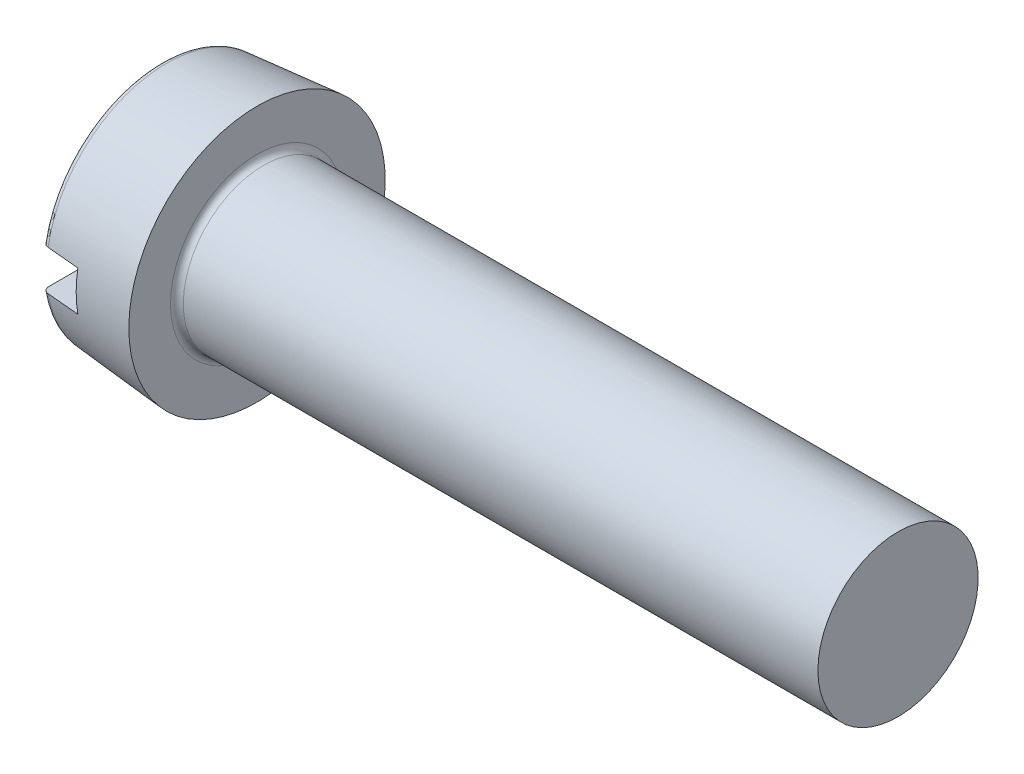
ISO-10303-21;
HEADER;
FILE_DESCRIPTION(('STEP AP214'),'2;1');
FILE_NAME('part.step','',(''),(''),'','','');
FILE_SCHEMA(('AUTOMOTIVE_DESIGN { 1 0 10303 214 1 1 1 1 }'));
ENDSEC;
DATA;
#1=APPLICATION_CONTEXT('core data for automotive mechanical design processes');
#2=APPLICATION_PROTOCOL_DEFINITION('international standard','automotive_design',2000,#1);
#3=PRODUCT_CONTEXT('',#1,'mechanical');
#4=PRODUCT('Part','Part','',(#3));
#5=PRODUCT_RELATED_PRODUCT_CATEGORY('part','',(#4));
#6=PRODUCT_DEFINITION_FORMATION('','',#4);
#7=PRODUCT_DEFINITION_CONTEXT('part definition',#1,'design');
#8=PRODUCT_DEFINITION('design','',#6,#7);
#9=PRODUCT_DEFINITION_SHAPE('','',#8);
#10=(LENGTH_UNIT() NAMED_UNIT(*) SI_UNIT(.MILLI.,.METRE.));
#11=(NAMED_UNIT(*) PLANE_ANGLE_UNIT() SI_UNIT($,.RADIAN.));
#12=(NAMED_UNIT(*) SI_UNIT($,.STERADIAN.) SOLID_ANGLE_UNIT());
#13=UNCERTAINTY_MEASURE_WITH_UNIT(LENGTH_MEASURE(1.E-05),#10,'distance_accuracy_value','');
#14=(GEOMETRIC_REPRESENTATION_CONTEXT(3) GLOBAL_UNCERTAINTY_ASSIGNED_CONTEXT((#13)) GLOBAL_UNIT_ASSIGNED_CONTEXT((#10,
#11,#12)) REPRESENTATION_CONTEXT('',''));
#15=CARTESIAN_POINT('',(0.,0.,0.));
#16=DIRECTION('',(0.,0.,1.));
#17=DIRECTION('',(1.,0.,0.));
#18=AXIS2_PLACEMENT_3D('',#15,#16,#17);
#19=CARTESIAN_POINT('',(0.,0.,0.));
#20=DIRECTION('',(1.,0.,0.));
#21=DIRECTION('',(0.,0.,-1.));
#22=AXIS2_PLACEMENT_3D('',#19,#20,#21);
#23=PLANE('',#22);
#24=CARTESIAN_POINT('',(0.,0.,0.));
#25=DIRECTION('',(1.,0.,0.));
#26=DIRECTION('',(0.,0.,-1.));
#27=AXIS2_PLACEMENT_3D('',#24,#25,#26);
#28=CIRCLE('',#27,7.10853554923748);
#29=CARTESIAN_POINT('',(0.,1.25,6.99776947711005));
#30=VERTEX_POINT('',#29);
#31=CARTESIAN_POINT('',(0.,1.25,-6.99776947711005));
#32=VERTEX_POINT('',#31);
#33=EDGE_CURVE('E115',#30,#32,#28,.F.);
#34=ORIENTED_EDGE('',*,*,#33,.T.);
#35=DIRECTION('',(0.,0.,-1.));
#36=VECTOR('',#35,1.);
#37=CARTESIAN_POINT('',(0.,1.25,-8.));
#38=LINE('',#37,#36);
#39=EDGE_CURVE('E112',#30,#32,#38,.T.);
#40=ORIENTED_EDGE('',*,*,#39,.F.);
#41=EDGE_LOOP('',(#34,#40));
#42=FACE_BOUND('',#41,.T.);
#43=ADVANCED_FACE('F45',(#42),#23,.F.);
#44=CARTESIAN_POINT('',(0.4,0.,0.));
#45=DIRECTION('',(1.,0.,0.));
#46=DIRECTION('',(0.,0.,-1.));
#47=AXIS2_PLACEMENT_3D('',#44,#45,#46);
#48=TOROIDAL_SURFACE('',#47,7.10853554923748,0.4);
#49=CARTESIAN_POINT('',(0.132475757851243,1.25,-7.29965638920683));
#50=CARTESIAN_POINT('',(0.148990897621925,1.25,-7.31472881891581));
#51=CARTESIAN_POINT('',(0.166777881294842,1.25,-7.32842972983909));
#52=CARTESIAN_POINT('',(0.204409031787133,1.25,-7.35266985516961));
#53=CARTESIAN_POINT('',(0.224255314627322,1.25,-7.36320577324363));
#54=CARTESIAN_POINT('',(0.265441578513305,1.25,-7.38078477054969));
#55=CARTESIAN_POINT('',(0.286781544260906,1.25,-7.38782788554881));
#56=CARTESIAN_POINT('',(0.330340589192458,1.25,-7.39820117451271));
#57=CARTESIAN_POINT('',(0.35255945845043,1.25,-7.40153222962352));
#58=CARTESIAN_POINT('',(0.397089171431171,1.25,-7.40437165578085));
#59=CARTESIAN_POINT('',(0.419398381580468,1.25,-7.40390568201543));
#60=CARTESIAN_POINT('',(0.463620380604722,1.25,-7.39922637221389));
#61=CARTESIAN_POINT('',(0.485533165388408,1.25,-7.39501299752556));
#62=CARTESIAN_POINT('',(0.528297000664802,1.25,-7.38298011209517));
#63=CARTESIAN_POINT('',(0.549150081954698,1.25,-7.37516781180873));
#64=CARTESIAN_POINT('',(0.589260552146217,1.25,-7.35617509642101));
#65=CARTESIAN_POINT('',(0.608517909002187,1.25,-7.34499461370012));
#66=CARTESIAN_POINT('',(0.645030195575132,1.25,-7.31951314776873));
#67=CARTESIAN_POINT('',(0.662271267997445,1.25,-7.30519231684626));
#68=CARTESIAN_POINT('',(0.694141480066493,1.25,-7.27389212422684));
#69=CARTESIAN_POINT('',(0.70877046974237,1.25,-7.25691260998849));
#70=CARTESIAN_POINT('',(0.735200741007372,1.25,-7.22055032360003));
#71=CARTESIAN_POINT('',(0.746964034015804,1.25,-7.20113994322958));
#72=CARTESIAN_POINT('',(0.767117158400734,1.25,-7.16064078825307));
#73=CARTESIAN_POINT('',(0.775506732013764,1.25,-7.13955188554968));
#74=CARTESIAN_POINT('',(0.788794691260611,1.25,-7.09597716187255));
#75=CARTESIAN_POINT('',(0.793642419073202,1.25,-7.07347588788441));
#76=CARTESIAN_POINT('',(0.79953214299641,1.25,-7.02798039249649));
#77=CARTESIAN_POINT('',(0.800573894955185,1.25,-7.00498613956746));
#78=CARTESIAN_POINT('',(0.79881979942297,1.25,-6.95891765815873));
#79=CARTESIAN_POINT('',(0.795986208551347,1.25,-6.93584485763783));
#80=CARTESIAN_POINT('',(0.786490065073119,1.25,-6.89050028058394));
#81=CARTESIAN_POINT('',(0.779827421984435,1.25,-6.86822852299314));
#82=CARTESIAN_POINT('',(0.762840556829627,1.25,-6.82510415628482));
#83=CARTESIAN_POINT('',(0.75251312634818,1.25,-6.80425280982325));
#84=CARTESIAN_POINT('',(0.728472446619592,1.25,-6.76460179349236));
#85=CARTESIAN_POINT('',(0.714759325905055,1.25,-6.74580204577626));
#86=CARTESIAN_POINT('',(0.684465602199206,1.25,-6.71098630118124));
#87=CARTESIAN_POINT('',(0.667913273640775,1.25,-6.6949457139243));
#88=CARTESIAN_POINT('',(0.632312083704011,1.25,-6.66592631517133));
#89=CARTESIAN_POINT('',(0.613263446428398,1.25,-6.6529472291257));
#90=CARTESIAN_POINT('',(0.573538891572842,1.25,-6.63064399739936));
#91=CARTESIAN_POINT('',(0.552894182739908,1.25,-6.62126426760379));
#92=CARTESIAN_POINT('',(0.510307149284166,1.25,-6.60616480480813));
#93=CARTESIAN_POINT('',(0.488364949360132,1.25,-6.60044472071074));
#94=CARTESIAN_POINT('',(0.444162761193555,1.25,-6.59290706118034));
#95=CARTESIAN_POINT('',(0.421912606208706,1.25,-6.59103174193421));
#96=CARTESIAN_POINT('',(0.377416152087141,1.25,-6.59106992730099));
#97=CARTESIAN_POINT('',(0.355169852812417,1.25,-6.59298324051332));
#98=CARTESIAN_POINT('',(0.311460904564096,1.25,-6.60051294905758));
#99=CARTESIAN_POINT('',(0.289994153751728,1.25,-6.60610558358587));
#100=CARTESIAN_POINT('',(0.248296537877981,1.25,-6.62079614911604));
#101=CARTESIAN_POINT('',(0.228065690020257,1.25,-6.62989412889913));
#102=CARTESIAN_POINT('',(0.189287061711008,1.25,-6.65137810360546));
#103=CARTESIAN_POINT('',(0.17074920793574,1.25,-6.66378200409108));
#104=CARTESIAN_POINT('',(0.135980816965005,1.25,-6.69148453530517));
#105=CARTESIAN_POINT('',(0.119750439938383,1.25,-6.7067833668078));
#106=CARTESIAN_POINT('',(0.0898040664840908,1.25,-6.74007476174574));
#107=CARTESIAN_POINT('',(0.0761278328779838,1.25,-6.75810308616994));
#108=CARTESIAN_POINT('',(0.051938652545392,1.25,-6.79616955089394));
#109=CARTESIAN_POINT('',(0.0414259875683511,1.25,-6.81620786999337));
#110=CARTESIAN_POINT('',(0.0236867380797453,1.25,-6.85807628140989));
#111=CARTESIAN_POINT('',(0.0165164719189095,1.25,-6.87993024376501));
#112=CARTESIAN_POINT('',(0.00590326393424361,1.25,-6.92452467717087));
#113=CARTESIAN_POINT('',(0.00246043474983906,1.25,-6.94726517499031));
#114=CARTESIAN_POINT('',(-0.0006244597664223,1.25,-6.9932443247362));
#115=CARTESIAN_POINT('',(-0.000226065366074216,1.25,-7.01648570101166));
#116=CARTESIAN_POINT('',(0.00446361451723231,1.25,-7.06257934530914));
#117=CARTESIAN_POINT('',(0.00875592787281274,1.25,-7.08543150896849));
#118=CARTESIAN_POINT('',(0.0211326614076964,1.25,-7.13011343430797));
#119=CARTESIAN_POINT('',(0.0292216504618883,1.25,-7.15194192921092));
#120=CARTESIAN_POINT('',(0.0489774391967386,1.25,-7.1938938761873));
#121=CARTESIAN_POINT('',(0.0606398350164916,1.25,-7.21401938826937));
#122=CARTESIAN_POINT('',(0.0824216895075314,1.25,-7.24513458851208));
#123=CARTESIAN_POINT('',(0.091585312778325,1.25,-7.25680502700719));
#124=CARTESIAN_POINT('',(0.111138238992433,1.25,-7.27907001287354));
#125=CARTESIAN_POINT('',(0.121527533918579,1.25,-7.28966456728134));
#126=CARTESIAN_POINT('',(0.132475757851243,1.25,-7.29965638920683));
#127=B_SPLINE_CURVE_WITH_KNOTS('',3,(#49,#50,#51,#52,#53,#54,#55,#56,#57,#58,#59,#60,#61,#62,
#63,#64,#65,#66,#67,#68,#69,#70,#71,#72,#73,#74,#75,#76,#77,#78,#79,#80,#81,#82,#83,#84,#85,#86,
#87,#88,#89,#90,#91,#92,#93,#94,#95,#96,#97,#98,#99,#100,#101,#102,#103,#104,#105,#106,#107,
#108,#109,#110,#111,#112,#113,#114,#115,#116,#117,#118,#119,#120,#121,#122,#123,#124,#125,#126),
.UNSPECIFIED.,.T.,.F.,(4,2,2,2,2,2,2,2,2,2,2,2,2,2,2,2,2,2,2,2,2,2,2,2,2,2,2,2,2,2,2,2,2,2,2,2,
2,2,4),(0.,0.067023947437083,0.134117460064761,0.20121028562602,0.268287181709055,
0.334911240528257,0.401535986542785,0.468027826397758,0.534521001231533,0.601447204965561,
0.66837724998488,0.736151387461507,0.803930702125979,0.87266141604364,0.94139653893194,
1.01080588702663,1.08021687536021,1.14968878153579,1.21915805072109,1.28797189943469,
1.35677957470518,1.4244772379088,1.49216840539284,1.55883525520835,1.62549873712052,
1.69173588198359,1.75797394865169,1.82457833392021,1.891187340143,1.95875976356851,
2.02633820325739,2.09501746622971,2.1636988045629,2.23310434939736,2.30252822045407,
2.37203585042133,2.44145816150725,2.48588999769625,2.53032154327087),.UNSPECIFIED.);
#128=CARTESIAN_POINT('',(0.365137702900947,1.25,-7.40221254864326));
#129=VERTEX_POINT('',#128);
#130=EDGE_CURVE('E69',#32,#129,#127,.T.);
#131=ORIENTED_EDGE('',*,*,#130,.F.);
#132=ORIENTED_EDGE('',*,*,#33,.F.);
#133=CARTESIAN_POINT('',(0.156685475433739,1.25,6.67501605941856));
#134=CARTESIAN_POINT('',(0.174256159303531,1.25,6.66131739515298));
#135=CARTESIAN_POINT('',(0.192982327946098,1.25,6.64907708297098));
#136=CARTESIAN_POINT('',(0.232233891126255,1.25,6.62789477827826));
#137=CARTESIAN_POINT('',(0.252761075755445,1.25,6.61895611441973));
#138=CARTESIAN_POINT('',(0.295032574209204,1.25,6.60466535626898));
#139=CARTESIAN_POINT('',(0.316776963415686,1.25,6.59931348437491));
#140=CARTESIAN_POINT('',(0.360853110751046,1.25,6.59236998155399));
#141=CARTESIAN_POINT('',(0.383184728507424,1.25,6.59077746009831));
#142=CARTESIAN_POINT('',(0.42762602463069,1.25,6.591398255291));
#143=CARTESIAN_POINT('',(0.44973610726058,1.25,6.59358298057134));
#144=CARTESIAN_POINT('',(0.493275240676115,1.25,6.60163431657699));
#145=CARTESIAN_POINT('',(0.514704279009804,1.25,6.60750099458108));
#146=CARTESIAN_POINT('',(0.556279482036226,1.25,6.6227333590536));
#147=CARTESIAN_POINT('',(0.576425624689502,1.25,6.63209910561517));
#148=CARTESIAN_POINT('',(0.614883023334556,1.25,6.65404433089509));
#149=CARTESIAN_POINT('',(0.633194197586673,1.25,6.66662395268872));
#150=CARTESIAN_POINT('',(0.667684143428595,1.25,6.69478087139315));
#151=CARTESIAN_POINT('',(0.683837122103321,1.25,6.71038975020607));
#152=CARTESIAN_POINT('',(0.713345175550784,1.25,6.74405889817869));
#153=CARTESIAN_POINT('',(0.726700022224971,1.25,6.76211936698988));
#154=CARTESIAN_POINT('',(0.750464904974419,1.25,6.80049672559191));
#155=CARTESIAN_POINT('',(0.760822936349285,1.25,6.82084582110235));
#156=CARTESIAN_POINT('',(0.778030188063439,1.25,6.86297712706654));
#157=CARTESIAN_POINT('',(0.784879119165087,1.25,6.88475945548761));
#158=CARTESIAN_POINT('',(0.79496410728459,1.25,6.92946740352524));
#159=CARTESIAN_POINT('',(0.798148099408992,1.25,6.95240477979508));
#160=CARTESIAN_POINT('',(0.800643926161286,1.25,6.99848978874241));
#161=CARTESIAN_POINT('',(0.799955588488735,1.25,7.02163743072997));
#162=CARTESIAN_POINT('',(0.794705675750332,1.25,7.06762095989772));
#163=CARTESIAN_POINT('',(0.790122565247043,1.25,7.0904543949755));
#164=CARTESIAN_POINT('',(0.777170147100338,1.25,7.13502176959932));
#165=CARTESIAN_POINT('',(0.768800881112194,1.25,7.15675572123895));
#166=CARTESIAN_POINT('',(0.748544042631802,1.25,7.19839107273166));
#167=CARTESIAN_POINT('',(0.736673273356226,1.25,7.2183006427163));
#168=CARTESIAN_POINT('',(0.709718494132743,1.25,7.25581170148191));
#169=CARTESIAN_POINT('',(0.694634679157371,1.25,7.27341333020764));
#170=CARTESIAN_POINT('',(0.661876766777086,1.25,7.30557422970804));
#171=CARTESIAN_POINT('',(0.644236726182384,1.25,7.32016818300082));
#172=CARTESIAN_POINT('',(0.606727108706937,1.25,7.34613622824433));
#173=CARTESIAN_POINT('',(0.586857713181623,1.25,7.35751058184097));
#174=CARTESIAN_POINT('',(0.545758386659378,1.25,7.37654767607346));
#175=CARTESIAN_POINT('',(0.524551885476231,1.25,7.38426101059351));
#176=CARTESIAN_POINT('',(0.481137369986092,1.25,7.39597548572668));
#177=CARTESIAN_POINT('',(0.458929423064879,1.25,7.39997687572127));
#178=CARTESIAN_POINT('',(0.414390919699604,1.25,7.40412092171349));
#179=CARTESIAN_POINT('',(0.392064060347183,1.25,7.40430340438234));
#180=CARTESIAN_POINT('',(0.347698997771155,1.25,7.40090585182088));
#181=CARTESIAN_POINT('',(0.325660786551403,1.25,7.39732592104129));
#182=CARTESIAN_POINT('',(0.282559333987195,1.25,7.38652855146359));
#183=CARTESIAN_POINT('',(0.26149359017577,1.25,7.37932109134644));
#184=CARTESIAN_POINT('',(0.220861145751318,1.25,7.36149175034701));
#185=CARTESIAN_POINT('',(0.201294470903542,1.25,7.35086981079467));
#186=CARTESIAN_POINT('',(0.164087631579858,1.25,7.32645533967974));
#187=CARTESIAN_POINT('',(0.146459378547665,1.25,7.31264466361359));
#188=CARTESIAN_POINT('',(0.113736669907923,1.25,7.28229253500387));
#189=CARTESIAN_POINT('',(0.0986423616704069,1.25,7.26575092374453));
#190=CARTESIAN_POINT('',(0.0712157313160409,1.25,7.23019262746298));
#191=CARTESIAN_POINT('',(0.0589194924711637,1.25,7.2111481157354));
#192=CARTESIAN_POINT('',(0.0376470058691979,1.25,7.17128762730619));
#193=CARTESIAN_POINT('',(0.0286710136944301,1.25,7.15047151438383));
#194=CARTESIAN_POINT('',(0.0141628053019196,1.25,7.10734319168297));
#195=CARTESIAN_POINT('',(0.00868112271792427,1.25,7.08501397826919));
#196=CARTESIAN_POINT('',(0.00150168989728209,1.25,7.03975592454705));
#197=CARTESIAN_POINT('',(-0.000195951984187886,1.25,7.01682706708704));
#198=CARTESIAN_POINT('',(0.000234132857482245,1.25,6.97076875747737));
#199=CARTESIAN_POINT('',(0.00240136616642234,1.25,6.94763966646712));
#200=CARTESIAN_POINT('',(0.0105811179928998,1.25,6.90206456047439));
#201=CARTESIAN_POINT('',(0.016594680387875,1.25,6.87961873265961));
#202=CARTESIAN_POINT('',(0.0323258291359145,1.25,6.83600920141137));
#203=CARTESIAN_POINT('',(0.0420516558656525,1.25,6.81484847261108));
#204=CARTESIAN_POINT('',(0.0649421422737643,1.25,6.77449865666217));
#205=CARTESIAN_POINT('',(0.0781025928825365,1.25,6.75530719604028));
#206=CARTESIAN_POINT('',(0.102248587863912,1.25,6.72585361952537));
#207=CARTESIAN_POINT('',(0.112339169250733,1.25,6.7148457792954));
#208=CARTESIAN_POINT('',(0.133675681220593,1.25,6.69401274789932));
#209=CARTESIAN_POINT('',(0.144921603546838,1.25,6.68418754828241));
#210=CARTESIAN_POINT('',(0.156685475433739,1.25,6.67501605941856));
#211=B_SPLINE_CURVE_WITH_KNOTS('',3,(#133,#134,#135,#136,#137,#138,#139,#140,#141,#142,#143,
#144,#145,#146,#147,#148,#149,#150,#151,#152,#153,#154,#155,#156,#157,#158,#159,#160,#161,#162,
#163,#164,#165,#166,#167,#168,#169,#170,#171,#172,#173,#174,#175,#176,#177,#178,#179,#180,#181,
#182,#183,#184,#185,#186,#187,#188,#189,#190,#191,#192,#193,#194,#195,#196,#197,#198,#199,#200,
#201,#202,#203,#204,#205,#206,#207,#208,#209,#210),.UNSPECIFIED.,.T.,.F.,(4,2,2,2,2,2,2,2,2,2,2,
2,2,2,2,2,2,2,2,2,2,2,2,2,2,2,2,2,2,2,2,2,2,2,2,2,2,2,4),(0.,0.0667854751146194,
0.133638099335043,0.200494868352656,0.267335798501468,0.333672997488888,0.400011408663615,
0.466350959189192,0.532693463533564,0.599768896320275,0.666849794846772,0.735033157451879,
0.803222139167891,0.872368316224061,0.941517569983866,1.01105167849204,1.08058502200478,
1.14978996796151,1.2189907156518,1.28734229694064,1.35568832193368,1.42306015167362,
1.49042745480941,1.55709184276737,1.62375438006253,1.69023453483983,1.75671583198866,
1.82358517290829,1.89045840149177,1.9581504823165,2.02584777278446,2.09450310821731,
2.1631604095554,2.23252355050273,2.30190552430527,2.37144241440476,2.4408944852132,
2.48560881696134,2.53032282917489),.UNSPECIFIED.);
#212=CARTESIAN_POINT('',(0.365137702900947,1.25,7.40221254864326));
#213=VERTEX_POINT('',#212);
#214=EDGE_CURVE('E105',#213,#30,#211,.T.);
#215=ORIENTED_EDGE('',*,*,#214,.F.);
#216=CARTESIAN_POINT('',(0.365137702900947,0.,0.));
#217=DIRECTION('',(-1.,0.,0.));
#218=DIRECTION('',(0.,0.,1.));
#219=AXIS2_PLACEMENT_3D('',#216,#217,#218);
#220=CIRCLE('',#219,7.50701342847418);
#221=EDGE_CURVE('E114',#129,#213,#220,.F.);
#222=ORIENTED_EDGE('',*,*,#221,.F.);
#223=EDGE_LOOP('',(#131,#132,#215,#222));
#224=FACE_BOUND('',#223,.T.);
#225=ADVANCED_FACE('F208',(#224),#48,.T.);
#226=CARTESIAN_POINT('',(0.,-1.25,-6.99776947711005));
#227=VERTEX_POINT('',#226);
#228=CARTESIAN_POINT('',(0.,-1.25,6.99776947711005));
#229=VERTEX_POINT('',#228);
#230=EDGE_CURVE('E111',#227,#229,#28,.F.);
#231=ORIENTED_EDGE('',*,*,#230,.T.);
#232=DIRECTION('',(0.,0.,1.));
#233=VECTOR('',#232,1.);
#234=CARTESIAN_POINT('',(0.,-1.25,-8.));
#235=LINE('',#234,#233);
#236=EDGE_CURVE('E61',#227,#229,#235,.T.);
#237=ORIENTED_EDGE('',*,*,#236,.F.);
#238=EDGE_LOOP('',(#231,#237));
#239=FACE_BOUND('',#238,.T.);
#240=ADVANCED_FACE('F110',(#239),#23,.F.);
#241=CARTESIAN_POINT('',(6.,0.,0.));
#242=DIRECTION('',(1.,0.,0.));
#243=DIRECTION('',(0.,0.,-1.));
#244=AXIS2_PLACEMENT_3D('',#241,#242,#243);
#245=CONICAL_SURFACE('',#244,8.,0.0872664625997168);
#246=CARTESIAN_POINT('',(2.4,0.,0.));
#247=DIRECTION('',(-1.,0.,0.));
#248=DIRECTION('',(0.,0.,1.));
#249=AXIS2_PLACEMENT_3D('',#246,#247,#248);
#250=CIRCLE('',#249,7.68504081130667);
#251=CARTESIAN_POINT('',(2.4,1.25,-7.58270085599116));
#252=VERTEX_POINT('',#251);
#253=CARTESIAN_POINT('',(2.4,-1.25,-7.58270085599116));
#254=VERTEX_POINT('',#253);
#255=EDGE_CURVE('E11',#252,#254,#250,.T.);
#256=ORIENTED_EDGE('',*,*,#255,.F.);
#257=CARTESIAN_POINT('',(15.1487514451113,1.25,-8.71118545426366));
#258=CARTESIAN_POINT('',(12.8323092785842,1.25,-8.50644348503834));
#259=CARTESIAN_POINT('',(10.5158792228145,1.25,-8.3015643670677));
#260=CARTESIAN_POINT('',(5.88305125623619,1.25,-7.89144412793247));
#261=CARTESIAN_POINT('',(3.56665334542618,1.25,-7.68620300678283));
#262=CARTESIAN_POINT('',(-1.06610264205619,1.25,-7.2752710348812));
#263=CARTESIAN_POINT('',(-3.38246071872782,1.25,-7.06958018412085));
#264=CARTESIAN_POINT('',(-8.01512399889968,1.25,-6.65760290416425));
#265=CARTESIAN_POINT('',(-10.3314292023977,1.25,-6.45131647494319));
#266=CARTESIAN_POINT('',(-12.6477013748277,1.25,-6.24465933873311));
#267=B_SPLINE_CURVE_WITH_KNOTS('',3,(#257,#258,#259,#260,#261,#262,#263,#264,#265,#266),
.UNSPECIFIED.,.F.,.F.,(4,2,2,2,4),(0.,6.97641830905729,13.9528363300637,20.9292544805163,
27.9056729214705),.UNSPECIFIED.);
#268=EDGE_CURVE('E178',#252,#129,#267,.T.);
#269=ORIENTED_EDGE('',*,*,#268,.T.);
#270=ORIENTED_EDGE('',*,*,#221,.T.);
#271=CARTESIAN_POINT('',(-12.6477013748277,1.25,6.24465933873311));
#272=CARTESIAN_POINT('',(-8.75782940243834,1.25,6.59168512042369));
#273=CARTESIAN_POINT('',(-4.86786867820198,1.25,6.93771339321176));
#274=CARTESIAN_POINT('',(-0.23514008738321,1.25,7.34895529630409));
#275=CARTESIAN_POINT('',(0.507566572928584,1.25,7.41485821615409));
#276=CARTESIAN_POINT('',(5.88303167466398,1.25,7.89166585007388));
#277=CARTESIAN_POINT('',(10.5158712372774,1.25,8.30165647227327));
#278=CARTESIAN_POINT('',(15.1487514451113,1.25,8.71118545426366));
#279=B_SPLINE_CURVE_WITH_KNOTS('',3,(#271,#272,#273,#274,#275,#276,#277,#278),.UNSPECIFIED.,.F.,
.F.,(4,2,2,4),(0.,11.7159620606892,13.952836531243,27.9056728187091),.UNSPECIFIED.);
#280=CARTESIAN_POINT('',(2.4,1.25,7.58270085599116));
#281=VERTEX_POINT('',#280);
#282=EDGE_CURVE('E172',#213,#281,#279,.T.);
#283=ORIENTED_EDGE('',*,*,#282,.T.);
#284=CARTESIAN_POINT('',(2.4,-1.25,7.58270085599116));
#285=VERTEX_POINT('',#284);
#286=EDGE_CURVE('E50',#285,#281,#250,.T.);
#287=ORIENTED_EDGE('',*,*,#286,.F.);
#288=CARTESIAN_POINT('',(15.1487514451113,-1.25,8.71118545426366));
#289=CARTESIAN_POINT('',(12.8323092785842,-1.25,8.50644348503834));
#290=CARTESIAN_POINT('',(10.5158792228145,-1.25,8.3015643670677));
#291=CARTESIAN_POINT('',(5.88305125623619,-1.25,7.89144412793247));
#292=CARTESIAN_POINT('',(3.56665334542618,-1.25,7.68620300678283));
#293=CARTESIAN_POINT('',(-1.06610264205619,-1.25,7.2752710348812));
#294=CARTESIAN_POINT('',(-3.38246071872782,-1.25,7.06958018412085));
#295=CARTESIAN_POINT('',(-8.01512399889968,-1.25,6.65760290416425));
#296=CARTESIAN_POINT('',(-10.3314292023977,-1.25,6.45131647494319));
#297=CARTESIAN_POINT('',(-12.6477013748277,-1.25,6.24465933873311));
#298=B_SPLINE_CURVE_WITH_KNOTS('',3,(#288,#289,#290,#291,#292,#293,#294,#295,#296,#297),
.UNSPECIFIED.,.F.,.F.,(4,2,2,2,4),(0.,6.97641830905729,13.9528363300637,20.9292544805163,
27.9056729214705),.UNSPECIFIED.);
#299=CARTESIAN_POINT('',(0.365137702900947,-1.25,7.40221254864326));
#300=VERTEX_POINT('',#299);
#301=EDGE_CURVE('E147',#285,#300,#298,.T.);
#302=ORIENTED_EDGE('',*,*,#301,.T.);
#303=CARTESIAN_POINT('',(0.365137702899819,-1.25,-7.40221254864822));
#304=VERTEX_POINT('',#303);
#305=EDGE_CURVE('E118',#300,#304,#220,.F.);
#306=ORIENTED_EDGE('',*,*,#305,.T.);
#307=CARTESIAN_POINT('',(-12.6477013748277,-1.25,-6.24465933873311));
#308=CARTESIAN_POINT('',(-8.7578294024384,-1.25,-6.59168512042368));
#309=CARTESIAN_POINT('',(-4.86786867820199,-1.25,-6.93771339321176));
#310=CARTESIAN_POINT('',(-0.235140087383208,-1.25,-7.34895529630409));
#311=CARTESIAN_POINT('',(0.507566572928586,-1.25,-7.41485821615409));
#312=CARTESIAN_POINT('',(5.88303167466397,-1.25,-7.89166585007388));
#313=CARTESIAN_POINT('',(10.5158712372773,-1.25,-8.30165647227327));
#314=CARTESIAN_POINT('',(15.1487514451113,-1.25,-8.71118545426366));
#315=B_SPLINE_CURVE_WITH_KNOTS('',3,(#307,#308,#309,#310,#311,#312,#313,#314),.UNSPECIFIED.,.F.,
.F.,(4,2,2,4),(0.,11.7159620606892,13.952836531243,27.9056728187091),.UNSPECIFIED.);
#316=EDGE_CURVE('E100',#304,#254,#315,.T.);
#317=ORIENTED_EDGE('',*,*,#316,.T.);
#318=EDGE_LOOP('',(#256,#269,#270,#283,#287,#302,#306,#317));
#319=FACE_BOUND('',#318,.T.);
#320=CARTESIAN_POINT('',(6.,0.,0.));
#321=DIRECTION('',(-1.,0.,0.));
#322=DIRECTION('',(0.,0.,1.));
#323=AXIS2_PLACEMENT_3D('',#320,#321,#322);
#324=CIRCLE('',#323,8.);
#325=CARTESIAN_POINT('',(6.,0.,8.));
#326=VERTEX_POINT('',#325);
#327=EDGE_CURVE('E187',#326,#326,#324,.T.);
#328=ORIENTED_EDGE('',*,*,#327,.T.);
#329=EDGE_LOOP('',(#328));
#330=FACE_BOUND('',#329,.T.);
#331=ADVANCED_FACE('F161',(#319,#330),#245,.T.);
#332=CARTESIAN_POINT('',(6.,8.,0.));
#333=DIRECTION('',(-1.,0.,0.));
#334=DIRECTION('',(0.,0.,1.));
#335=AXIS2_PLACEMENT_3D('',#332,#333,#334);
#336=PLANE('',#335);
#337=CARTESIAN_POINT('',(6.,0.,0.));
#338=DIRECTION('',(-1.,0.,0.));
#339=DIRECTION('',(0.,0.,1.));
#340=AXIS2_PLACEMENT_3D('',#337,#338,#339);
#341=CIRCLE('',#340,5.4);
#342=CARTESIAN_POINT('',(6.,0.,5.4));
#343=VERTEX_POINT('',#342);
#344=EDGE_CURVE('E189',#343,#343,#341,.T.);
#345=ORIENTED_EDGE('',*,*,#344,.T.);
#346=EDGE_LOOP('',(#345));
#347=FACE_BOUND('',#346,.T.);
#348=ORIENTED_EDGE('',*,*,#327,.F.);
#349=EDGE_LOOP('',(#348));
#350=FACE_BOUND('',#349,.T.);
#351=ADVANCED_FACE('F166',(#347,#350),#336,.F.);
#352=CARTESIAN_POINT('',(0.,0.,0.));
#353=DIRECTION('',(-1.,0.,0.));
#354=DIRECTION('',(0.,0.,1.));
#355=AXIS2_PLACEMENT_3D('',#352,#353,#354);
#356=CYLINDRICAL_SURFACE('',#355,5.);
#357=CARTESIAN_POINT('',(6.4,0.,0.));
#358=DIRECTION('',(-1.,0.,0.));
#359=DIRECTION('',(0.,0.,1.));
#360=AXIS2_PLACEMENT_3D('',#357,#358,#359);
#361=CIRCLE('',#360,5.);
#362=CARTESIAN_POINT('',(6.4,0.,5.));
#363=VERTEX_POINT('',#362);
#364=EDGE_CURVE('E121',#363,#363,#361,.F.);
#365=ORIENTED_EDGE('',*,*,#364,.T.);
#366=EDGE_LOOP('',(#365));
#367=FACE_BOUND('',#366,.T.);
#368=CARTESIAN_POINT('',(46.,0.,0.));
#369=DIRECTION('',(-1.,0.,0.));
#370=DIRECTION('',(0.,0.,1.));
#371=AXIS2_PLACEMENT_3D('',#368,#369,#370);
#372=CIRCLE('',#371,5.);
#373=CARTESIAN_POINT('',(46.,0.,5.));
#374=VERTEX_POINT('',#373);
#375=EDGE_CURVE('E184',#374,#374,#372,.T.);
#376=ORIENTED_EDGE('',*,*,#375,.T.);
#377=EDGE_LOOP('',(#376));
#378=FACE_BOUND('',#377,.T.);
#379=ADVANCED_FACE('F196',(#367,#378),#356,.T.);
#380=CARTESIAN_POINT('',(46.,5.,0.));
#381=DIRECTION('',(-1.,0.,0.));
#382=DIRECTION('',(0.,0.,1.));
#383=AXIS2_PLACEMENT_3D('',#380,#381,#382);
#384=PLANE('',#383);
#385=ORIENTED_EDGE('',*,*,#375,.F.);
#386=EDGE_LOOP('',(#385));
#387=FACE_BOUND('',#386,.T.);
#388=ADVANCED_FACE('F140',(#387),#384,.F.);
#389=CARTESIAN_POINT('',(6.4,0.,0.));
#390=DIRECTION('',(-1.,0.,0.));
#391=DIRECTION('',(0.,0.,1.));
#392=AXIS2_PLACEMENT_3D('',#389,#390,#391);
#393=TOROIDAL_SURFACE('',#392,5.4,0.4);
#394=ORIENTED_EDGE('',*,*,#364,.F.);
#395=EDGE_LOOP('',(#394));
#396=FACE_BOUND('',#395,.T.);
#397=ORIENTED_EDGE('',*,*,#344,.F.);
#398=EDGE_LOOP('',(#397));
#399=FACE_BOUND('',#398,.T.);
#400=ADVANCED_FACE('F199',(#396,#399),#393,.F.);
#401=CARTESIAN_POINT('',(0.132475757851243,-1.25,-7.29965638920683));
#402=CARTESIAN_POINT('',(0.115625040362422,-1.25,-7.28427494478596));
#403=CARTESIAN_POINT('',(0.100074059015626,-1.25,-7.26744265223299));
#404=CARTESIAN_POINT('',(0.0720165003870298,-1.25,-7.2313837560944));
#405=CARTESIAN_POINT('',(0.0595141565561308,-1.25,-7.21215387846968));
#406=CARTESIAN_POINT('',(0.0379148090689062,-1.25,-7.17189363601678));
#407=CARTESIAN_POINT('',(0.0288141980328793,-1.25,-7.15086520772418));
#408=CARTESIAN_POINT('',(0.0142370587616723,-1.25,-7.10759561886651));
#409=CARTESIAN_POINT('',(0.00875961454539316,-1.25,-7.08535476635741));
#410=CARTESIAN_POINT('',(0.0015248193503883,-1.25,-7.04005432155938));
#411=CARTESIAN_POINT('',(-0.000195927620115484,-1.25,-7.01698887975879));
#412=CARTESIAN_POINT('',(0.000231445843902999,-1.25,-6.9708922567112));
#413=CARTESIAN_POINT('',(0.00237993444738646,-1.25,-6.9478610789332));
#414=CARTESIAN_POINT('',(0.0105153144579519,-1.25,-6.90232994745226));
#415=CARTESIAN_POINT('',(0.0165272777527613,-1.25,-6.87983446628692));
#416=CARTESIAN_POINT('',(0.032255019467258,-1.25,-6.8361768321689));
#417=CARTESIAN_POINT('',(0.0419707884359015,-1.25,-6.81501467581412));
#418=CARTESIAN_POINT('',(0.0648081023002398,-1.25,-6.77471156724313));
#419=CARTESIAN_POINT('',(0.0779176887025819,-1.25,-6.75556384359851));
#420=CARTESIAN_POINT('',(0.107204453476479,-1.25,-6.71977775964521));
#421=CARTESIAN_POINT('',(0.12338143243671,-1.25,-6.70313923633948));
#422=CARTESIAN_POINT('',(0.158125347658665,-1.25,-6.6730806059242));
#423=CARTESIAN_POINT('',(0.176658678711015,-1.25,-6.65962166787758));
#424=CARTESIAN_POINT('',(0.215753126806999,-1.25,-6.63606890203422));
#425=CARTESIAN_POINT('',(0.236314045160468,-1.25,-6.62597474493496));
#426=CARTESIAN_POINT('',(0.278509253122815,-1.25,-6.60961442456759));
#427=CARTESIAN_POINT('',(0.300119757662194,-1.25,-6.60328690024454));
#428=CARTESIAN_POINT('',(0.344101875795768,-1.25,-6.59440049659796));
#429=CARTESIAN_POINT('',(0.366473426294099,-1.25,-6.59184130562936));
#430=CARTESIAN_POINT('',(0.411048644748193,-1.25,-6.59058150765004));
#431=CARTESIAN_POINT('',(0.433250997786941,-1.25,-6.59183387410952));
#432=CARTESIAN_POINT('',(0.477127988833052,-1.25,-6.59805510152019));
#433=CARTESIAN_POINT('',(0.498802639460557,-1.25,-6.60302387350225));
#434=CARTESIAN_POINT('',(0.540980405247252,-1.25,-6.61651171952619));
#435=CARTESIAN_POINT('',(0.561485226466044,-1.25,-6.62502546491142));
#436=CARTESIAN_POINT('',(0.600794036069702,-1.25,-6.64534193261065));
#437=CARTESIAN_POINT('',(0.61959795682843,-1.25,-6.65714478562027));
#438=CARTESIAN_POINT('',(0.655176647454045,-1.25,-6.68382050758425));
#439=CARTESIAN_POINT('',(0.671929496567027,-1.25,-6.6987226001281));
#440=CARTESIAN_POINT('',(0.702744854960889,-1.25,-6.73108753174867));
#441=CARTESIAN_POINT('',(0.716807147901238,-1.25,-6.74855057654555));
#442=CARTESIAN_POINT('',(0.74208432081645,-1.25,-6.78584352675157));
#443=CARTESIAN_POINT('',(0.753249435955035,-1.25,-6.8057071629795));
#444=CARTESIAN_POINT('',(0.77214252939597,-1.25,-6.84700674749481));
#445=CARTESIAN_POINT('',(0.779870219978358,-1.25,-6.8684428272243));
#446=CARTESIAN_POINT('',(0.79177945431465,-1.25,-6.91261830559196));
#447=CARTESIAN_POINT('',(0.795907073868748,-1.25,-6.93537225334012));
#448=CARTESIAN_POINT('',(0.800312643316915,-1.25,-6.9812503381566));
#449=CARTESIAN_POINT('',(0.800590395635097,-1.25,-7.00437449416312));
#450=CARTESIAN_POINT('',(0.797273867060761,-1.25,-7.05050308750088));
#451=CARTESIAN_POINT('',(0.793653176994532,-1.25,-7.07350563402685));
#452=CARTESIAN_POINT('',(0.782588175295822,-1.25,-7.11857275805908));
#453=CARTESIAN_POINT('',(0.775143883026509,-1.25,-7.1406373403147));
#454=CARTESIAN_POINT('',(0.756658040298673,-1.25,-7.18311323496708));
#455=CARTESIAN_POINT('',(0.745629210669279,-1.25,-7.2035300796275));
#456=CARTESIAN_POINT('',(0.720262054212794,-1.25,-7.24219335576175));
#457=CARTESIAN_POINT('',(0.705923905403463,-1.25,-7.26043990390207));
#458=CARTESIAN_POINT('',(0.674518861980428,-1.25,-7.29401378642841));
#459=CARTESIAN_POINT('',(0.657485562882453,-1.25,-7.30937253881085));
#460=CARTESIAN_POINT('',(0.621049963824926,-1.25,-7.33696221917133));
#461=CARTESIAN_POINT('',(0.601647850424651,-1.25,-7.34919339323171));
#462=CARTESIAN_POINT('',(0.561324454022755,-1.25,-7.3699966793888));
#463=CARTESIAN_POINT('',(0.540428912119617,-1.25,-7.37861869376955));
#464=CARTESIAN_POINT('',(0.497477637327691,-1.25,-7.39218682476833));
#465=CARTESIAN_POINT('',(0.475422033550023,-1.25,-7.39713334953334));
#466=CARTESIAN_POINT('',(0.431043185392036,-1.25,-7.4031624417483));
#467=CARTESIAN_POINT('',(0.408725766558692,-1.25,-7.40428796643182));
#468=CARTESIAN_POINT('',(0.364214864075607,-1.25,-7.40276022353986));
#469=CARTESIAN_POINT('',(0.34202140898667,-1.25,-7.40010611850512));
#470=CARTESIAN_POINT('',(0.29847323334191,-1.25,-7.39111627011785));
#471=CARTESIAN_POINT('',(0.277115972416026,-1.25,-7.38479278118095));
#472=CARTESIAN_POINT('',(0.235778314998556,-1.25,-7.36866899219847));
#473=CARTESIAN_POINT('',(0.215796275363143,-1.25,-7.35887293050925));
#474=CARTESIAN_POINT('',(0.185293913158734,-1.25,-7.34062461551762));
#475=CARTESIAN_POINT('',(0.174160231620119,-1.25,-7.33317637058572));
#476=CARTESIAN_POINT('',(0.152693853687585,-1.25,-7.31720397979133));
#477=CARTESIAN_POINT('',(0.142361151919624,-1.25,-7.30867984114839));
#478=CARTESIAN_POINT('',(0.132475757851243,-1.25,-7.29965638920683));
#479=B_SPLINE_CURVE_WITH_KNOTS('',3,(#401,#402,#403,#404,#405,#406,#407,#408,#409,#410,#411,
#412,#413,#414,#415,#416,#417,#418,#419,#420,#421,#422,#423,#424,#425,#426,#427,#428,#429,#430,
#431,#432,#433,#434,#435,#436,#437,#438,#439,#440,#441,#442,#443,#444,#445,#446,#447,#448,#449,
#450,#451,#452,#453,#454,#455,#456,#457,#458,#459,#460,#461,#462,#463,#464,#465,#466,#467,#468,
#469,#470,#471,#472,#473,#474,#475,#476,#477,#478),.UNSPECIFIED.,.T.,.F.,(4,2,2,2,2,2,2,2,2,2,2,
2,2,2,2,2,2,2,2,2,2,2,2,2,2,2,2,2,2,2,2,2,2,2,2,2,2,2,4),(0.,0.0683960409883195,
0.136886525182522,0.205304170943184,0.273704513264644,0.342768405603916,0.411838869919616,
0.481362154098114,0.55088526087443,0.620166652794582,0.689443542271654,0.757824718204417,
0.826199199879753,0.893426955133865,0.960649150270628,1.02704534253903,1.09343994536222,
1.1597351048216,1.22603289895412,1.29298674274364,1.35994596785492,1.42798884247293,
1.49603741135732,1.5650885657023,1.63414326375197,1.70366871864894,1.77319382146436,
1.84247483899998,1.91175213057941,1.98022551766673,2.04869351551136,2.11618078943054,
2.1836605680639,2.25037915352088,2.3171125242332,2.38362430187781,2.45005517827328,
2.49017966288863,2.53030387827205),.UNSPECIFIED.);
#480=EDGE_CURVE('E96',#304,#227,#479,.T.);
#481=ORIENTED_EDGE('',*,*,#480,.F.);
#482=ORIENTED_EDGE('',*,*,#305,.F.);
#483=CARTESIAN_POINT('',(0.156685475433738,-1.25,6.67501605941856));
#484=CARTESIAN_POINT('',(0.13869744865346,-1.25,6.68904266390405));
#485=CARTESIAN_POINT('',(0.121894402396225,-1.25,6.70461880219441));
#486=CARTESIAN_POINT('',(0.0911386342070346,-1.25,6.7383941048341));
#487=CARTESIAN_POINT('',(0.077189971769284,-1.25,6.75659694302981));
#488=CARTESIAN_POINT('',(0.0525468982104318,-1.25,6.79505798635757));
#489=CARTESIAN_POINT('',(0.0418488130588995,-1.25,6.81531383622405));
#490=CARTESIAN_POINT('',(0.0239673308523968,-1.25,6.85731331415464));
#491=CARTESIAN_POINT('',(0.0167830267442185,-1.25,6.87905655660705));
#492=CARTESIAN_POINT('',(0.00605038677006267,-1.25,6.92366828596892));
#493=CARTESIAN_POINT('',(0.00254158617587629,-1.25,6.94654629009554));
#494=CARTESIAN_POINT('',(-0.000611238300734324,-1.25,6.9925687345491));
#495=CARTESIAN_POINT('',(-0.000254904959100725,-1.25,7.01571319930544));
#496=CARTESIAN_POINT('',(0.00433168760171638,-1.25,7.06175648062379));
#497=CARTESIAN_POINT('',(0.00858518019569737,-1.25,7.0846529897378));
#498=CARTESIAN_POINT('',(0.0208920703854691,-1.25,7.1294017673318));
#499=CARTESIAN_POINT('',(0.0289454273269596,-1.25,7.15125404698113));
#500=CARTESIAN_POINT('',(0.048598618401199,-1.25,7.19318711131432));
#501=CARTESIAN_POINT('',(0.0601830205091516,-1.25,7.21327512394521));
#502=CARTESIAN_POINT('',(0.086598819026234,-1.25,7.25118974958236));
#503=CARTESIAN_POINT('',(0.101430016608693,-1.25,7.2690165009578));
#504=CARTESIAN_POINT('',(0.133730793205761,-1.25,7.3016689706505));
#505=CARTESIAN_POINT('',(0.151166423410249,-1.25,7.31652826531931));
#506=CARTESIAN_POINT('',(0.188315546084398,-1.25,7.34305785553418));
#507=CARTESIAN_POINT('',(0.208028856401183,-1.25,7.35472840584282));
#508=CARTESIAN_POINT('',(0.248870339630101,-1.25,7.37437491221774));
#509=CARTESIAN_POINT('',(0.269974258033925,-1.25,7.38240129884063));
#510=CARTESIAN_POINT('',(0.313238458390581,-1.25,7.3947537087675));
#511=CARTESIAN_POINT('',(0.335398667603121,-1.25,7.39907998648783));
#512=CARTESIAN_POINT('',(0.379892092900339,-1.25,7.40387138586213));
#513=CARTESIAN_POINT('',(0.402220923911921,-1.25,7.40437730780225));
#514=CARTESIAN_POINT('',(0.446644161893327,-1.25,7.40162021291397));
#515=CARTESIAN_POINT('',(0.46873857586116,-1.25,7.39835730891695));
#516=CARTESIAN_POINT('',(0.511996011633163,-1.25,7.3881790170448));
#517=CARTESIAN_POINT('',(0.533161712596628,-1.25,7.38127500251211));
#518=CARTESIAN_POINT('',(0.57404270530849,-1.25,7.36403039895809));
#519=CARTESIAN_POINT('',(0.593757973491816,-1.25,7.35368975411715));
#520=CARTESIAN_POINT('',(0.631300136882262,-1.25,7.32981351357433));
#521=CARTESIAN_POINT('',(0.649116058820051,-1.25,7.31626067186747));
#522=CARTESIAN_POINT('',(0.682253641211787,-1.25,7.28638902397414));
#523=CARTESIAN_POINT('',(0.697575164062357,-1.25,7.27007006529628));
#524=CARTESIAN_POINT('',(0.725489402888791,-1.25,7.23492204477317));
#525=CARTESIAN_POINT('',(0.738047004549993,-1.25,7.21606510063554));
#526=CARTESIAN_POINT('',(0.759869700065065,-1.25,7.17653402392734));
#527=CARTESIAN_POINT('',(0.769134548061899,-1.25,7.15585975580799));
#528=CARTESIAN_POINT('',(0.784244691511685,-1.25,7.11296720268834));
#529=CARTESIAN_POINT('',(0.79003968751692,-1.25,7.09073119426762));
#530=CARTESIAN_POINT('',(0.797858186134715,-1.25,7.04560551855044));
#531=CARTESIAN_POINT('',(0.79988143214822,-1.25,7.0227158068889));
#532=CARTESIAN_POINT('',(0.80010962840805,-1.25,6.97667253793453));
#533=CARTESIAN_POINT('',(0.798273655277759,-1.25,6.95351876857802));
#534=CARTESIAN_POINT('',(0.790750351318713,-1.25,6.90784486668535));
#535=CARTESIAN_POINT('',(0.785062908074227,-1.25,6.88532475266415));
#536=CARTESIAN_POINT('',(0.769969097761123,-1.25,6.84151070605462));
#537=CARTESIAN_POINT('',(0.760554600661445,-1.25,6.8202195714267));
#538=CARTESIAN_POINT('',(0.738256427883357,-1.25,6.77953758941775));
#539=CARTESIAN_POINT('',(0.725372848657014,-1.25,6.76014668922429));
#540=CARTESIAN_POINT('',(0.696604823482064,-1.25,6.72399477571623));
#541=CARTESIAN_POINT('',(0.680745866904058,-1.25,6.70721348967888));
#542=CARTESIAN_POINT('',(0.646395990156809,-1.25,6.67660331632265));
#543=CARTESIAN_POINT('',(0.627905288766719,-1.25,6.66277418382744));
#544=CARTESIAN_POINT('',(0.589124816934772,-1.25,6.638694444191));
#545=CARTESIAN_POINT('',(0.568867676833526,-1.25,6.62839129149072));
#546=CARTESIAN_POINT('',(0.52689252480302,-1.25,6.61139516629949));
#547=CARTESIAN_POINT('',(0.505174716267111,-1.25,6.60470169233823));
#548=CARTESIAN_POINT('',(0.461264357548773,-1.25,6.59521646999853));
#549=CARTESIAN_POINT('',(0.439084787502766,-1.25,6.59236456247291));
#550=CARTESIAN_POINT('',(0.394557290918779,-1.25,6.59045711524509));
#551=CARTESIAN_POINT('',(0.372209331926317,-1.25,6.59140232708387));
#552=CARTESIAN_POINT('',(0.328161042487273,-1.25,6.59703803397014));
#553=CARTESIAN_POINT('',(0.306457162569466,-1.25,6.60170098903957));
#554=CARTESIAN_POINT('',(0.264155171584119,-1.25,6.61458958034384));
#555=CARTESIAN_POINT('',(0.243555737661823,-1.25,6.62281084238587));
#556=CARTESIAN_POINT('',(0.211940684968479,-1.25,6.63859503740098));
#557=CARTESIAN_POINT('',(0.200387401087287,-1.25,6.64510594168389));
#558=CARTESIAN_POINT('',(0.177984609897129,-1.25,6.65924228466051));
#559=CARTESIAN_POINT('',(0.167135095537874,-1.25,6.66686771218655));
#560=CARTESIAN_POINT('',(0.156685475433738,-1.25,6.67501605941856));
#561=B_SPLINE_CURVE_WITH_KNOTS('',3,(#483,#484,#485,#486,#487,#488,#489,#490,#491,#492,#493,
#494,#495,#496,#497,#498,#499,#500,#501,#502,#503,#504,#505,#506,#507,#508,#509,#510,#511,#512,
#513,#514,#515,#516,#517,#518,#519,#520,#521,#522,#523,#524,#525,#526,#527,#528,#529,#530,#531,
#532,#533,#534,#535,#536,#537,#538,#539,#540,#541,#542,#543,#544,#545,#546,#547,#548,#549,#550,
#551,#552,#553,#554,#555,#556,#557,#558,#559,#560),.UNSPECIFIED.,.T.,.F.,(4,2,2,2,2,2,2,2,2,2,2,
2,2,2,2,2,2,2,2,2,2,2,2,2,2,2,2,2,2,2,2,2,2,2,2,2,2,2,4),(0.,0.0683818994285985,
0.13686038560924,0.205261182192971,0.273644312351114,0.34275567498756,0.411873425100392,
0.481405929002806,0.550937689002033,0.620169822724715,0.68939771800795,0.757791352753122,
0.826179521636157,0.893590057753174,0.960995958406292,1.02768095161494,1.09436394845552,
1.16083987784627,1.22731688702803,1.29415923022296,1.36100525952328,1.42865694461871,
1.49631367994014,1.56492881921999,1.63354862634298,1.70289975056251,1.77225289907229,
1.84175817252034,1.91126151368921,1.98019458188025,2.04912192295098,2.11697211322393,
2.18481287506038,2.25157839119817,2.31835712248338,2.38464572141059,2.45085306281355,
2.49057793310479,2.53030240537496),.UNSPECIFIED.);
#562=EDGE_CURVE('E106',#229,#300,#561,.T.);
#563=ORIENTED_EDGE('',*,*,#562,.F.);
#564=ORIENTED_EDGE('',*,*,#230,.F.);
#565=EDGE_LOOP('',(#481,#482,#563,#564));
#566=FACE_BOUND('',#565,.T.);
#567=ADVANCED_FACE('F47',(#566),#48,.T.);
#568=CARTESIAN_POINT('',(2.4,-1.25,-8.));
#569=DIRECTION('',(-1.,0.,0.));
#570=DIRECTION('',(0.,0.,1.));
#571=AXIS2_PLACEMENT_3D('',#568,#569,#570);
#572=PLANE('',#571);
#573=ORIENTED_EDGE('',*,*,#255,.T.);
#574=DIRECTION('',(0.,0.,1.));
#575=VECTOR('',#574,1.);
#576=CARTESIAN_POINT('',(2.4,-1.25,-8.));
#577=LINE('',#576,#575);
#578=EDGE_CURVE('E302',#254,#285,#577,.T.);
#579=ORIENTED_EDGE('',*,*,#578,.T.);
#580=ORIENTED_EDGE('',*,*,#286,.T.);
#581=DIRECTION('',(0.,0.,-1.));
#582=VECTOR('',#581,1.);
#583=CARTESIAN_POINT('',(2.4,1.25,-8.));
#584=LINE('',#583,#582);
#585=EDGE_CURVE('E155',#281,#252,#584,.T.);
#586=ORIENTED_EDGE('',*,*,#585,.T.);
#587=EDGE_LOOP('',(#573,#579,#580,#586));
#588=FACE_BOUND('',#587,.T.);
#589=ADVANCED_FACE('F207',(#588),#572,.T.);
#590=CARTESIAN_POINT('',(2.4,1.25,-8.));
#591=DIRECTION('',(0.,1.,0.));
#592=DIRECTION('',(0.,0.,1.));
#593=AXIS2_PLACEMENT_3D('',#590,#591,#592);
#594=PLANE('',#593);
#595=ORIENTED_EDGE('',*,*,#585,.F.);
#596=ORIENTED_EDGE('',*,*,#282,.F.);
#597=ORIENTED_EDGE('',*,*,#214,.T.);
#598=ORIENTED_EDGE('',*,*,#39,.T.);
#599=ORIENTED_EDGE('',*,*,#130,.T.);
#600=ORIENTED_EDGE('',*,*,#268,.F.);
#601=EDGE_LOOP('',(#595,#596,#597,#598,#599,#600));
#602=FACE_BOUND('',#601,.T.);
#603=ADVANCED_FACE('F137',(#602),#594,.F.);
#604=CARTESIAN_POINT('',(2.4,-1.25,-8.));
#605=DIRECTION('',(0.,-1.,0.));
#606=DIRECTION('',(0.,0.,-1.));
#607=AXIS2_PLACEMENT_3D('',#604,#605,#606);
#608=PLANE('',#607);
#609=ORIENTED_EDGE('',*,*,#480,.T.);
#610=ORIENTED_EDGE('',*,*,#236,.T.);
#611=ORIENTED_EDGE('',*,*,#562,.T.);
#612=ORIENTED_EDGE('',*,*,#301,.F.);
#613=ORIENTED_EDGE('',*,*,#578,.F.);
#614=ORIENTED_EDGE('',*,*,#316,.F.);
#615=EDGE_LOOP('',(#609,#610,#611,#612,#613,#614));
#616=FACE_BOUND('',#615,.T.);
#617=ADVANCED_FACE('F97',(#616),#608,.F.);
#618=CLOSED_SHELL('',(#43,#225,#240,#331,#351,#379,#388,#400,#567,#589,#603,#617));
#619=MANIFOLD_SOLID_BREP('B2',#618);
#620=ADVANCED_BREP_SHAPE_REPRESENTATION('',(#18,#619),#14);
#621=SHAPE_DEFINITION_REPRESENTATION(#9,#620);
ENDSEC;
END-ISO-10303-21;
